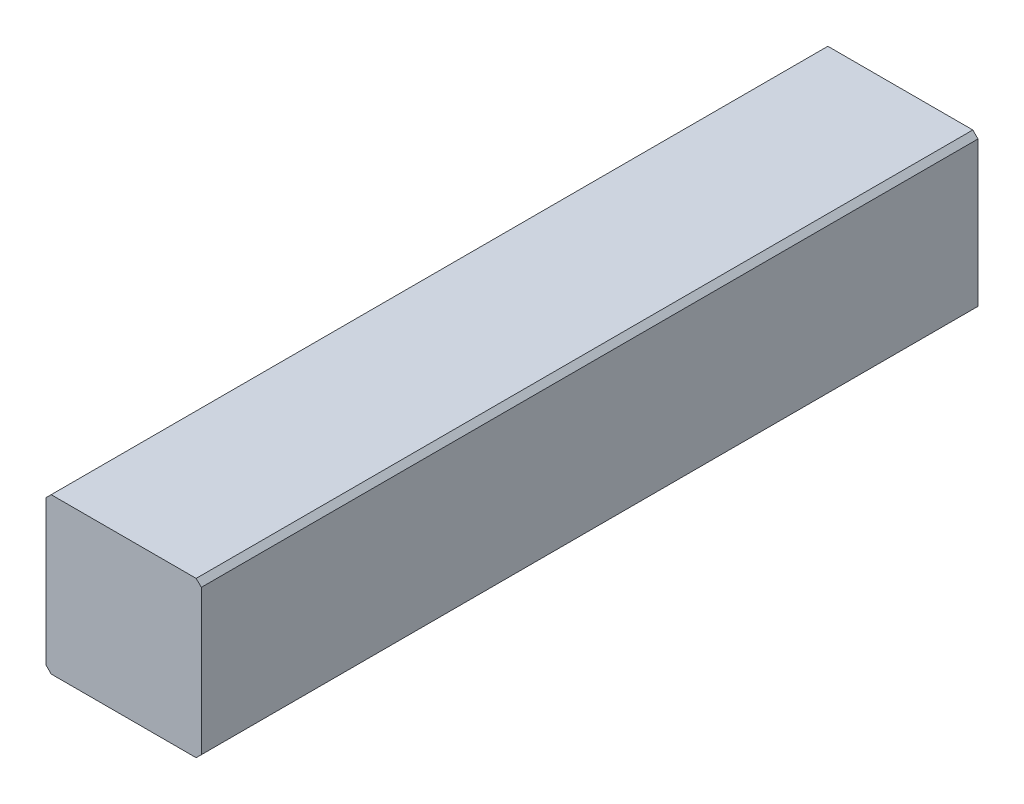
from build123d import *

# Parameters (mm, degrees)
ESQUISSE1_W      = 6
ESQUISSE1_H      = 6
EXTRUSION1_DEPTH = 15
CHANFREIN1_SIZE  = 0.2


with BuildPart() as part:
    # Esquisse1 → Extrusion1 (new, symmetric)
    with BuildSketch(Plane.XY):
        Rectangle(ESQUISSE1_W, ESQUISSE1_H)
    extrude(amount=EXTRUSION1_DEPTH, both=True)

    # Chanfrein1
    chanfrein1_edges = [part.edges().sort_by_distance(p)[0] for p in [
        (-3, 3, 0),
        (3, 3, 0),
        (3, -3, 0),
        (-3, -3, 0),
    ]]
    chamfer(chanfrein1_edges, length=CHANFREIN1_SIZE)


solid = part.part
